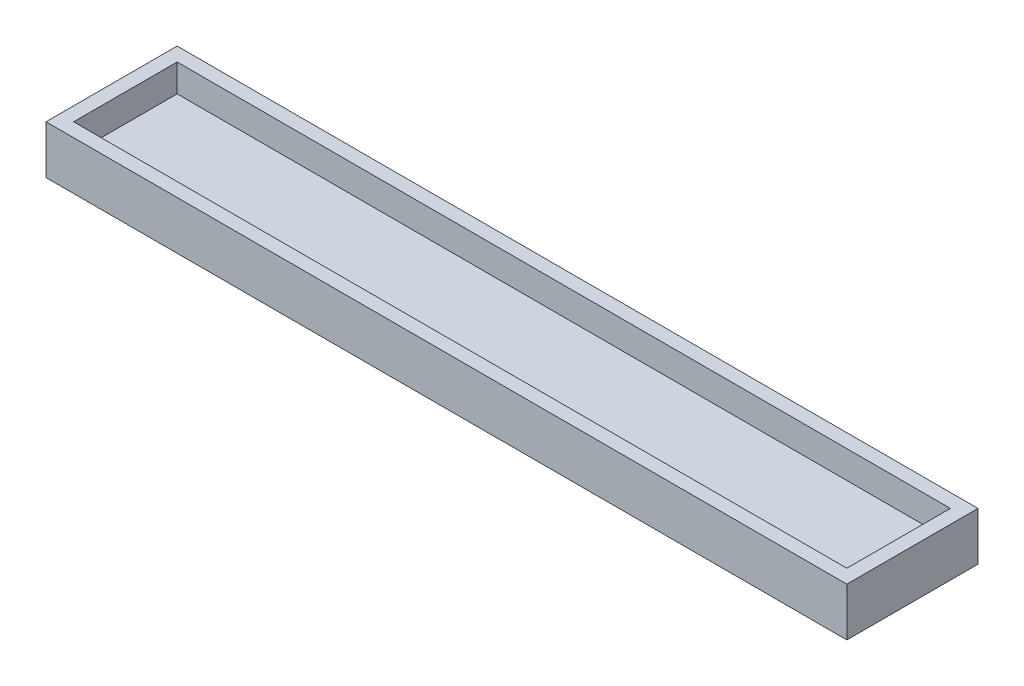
from build123d import *

# Parameters (mm, degrees)
SKETCH1_W         = 112
SKETCH1_H         = 15
BOTTOM_DEPTH      = 3
SKETCH1_3_W       = 116
SKETCH1_3_H       = 19
SKETCH1_3_W_2     = 112
SKETCH1_3_H_2     = 15
RAISED_EDGE_DEPTH = 7


with BuildPart() as part:
    # Sketch1 → bottom (new body)
    with BuildSketch(Plane(origin=(0, 0, 0), x_dir=(1, 0, 0), z_dir=(0, 1, 0))):
        with Locations((56, 7.5)):
            Rectangle(SKETCH1_W, SKETCH1_H)
    extrude(amount=BOTTOM_DEPTH)

    # Sketch1_3 → raised edge (add)
    with BuildSketch(Plane(origin=(0, 0, 0), x_dir=(1, 0, 0), z_dir=(0, 1, 0))):
        with Locations((56, 7.5)):
            Rectangle(SKETCH1_3_W, SKETCH1_3_H)
        with Locations((56, 7.5)):
            Rectangle(SKETCH1_3_W_2, SKETCH1_3_H_2, mode=Mode.SUBTRACT)
    extrude(amount=RAISED_EDGE_DEPTH)


solid = part.part
